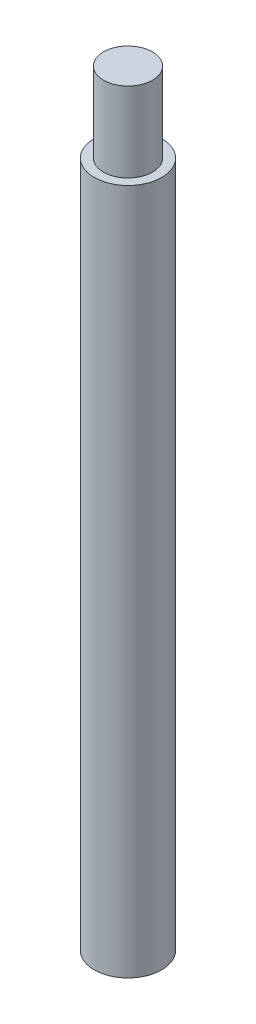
from build123d import *

# Parameters (mm, degrees)
SKETCH1_R           = 17.4625
BASE_EXTRUDE_DEPTH  = 355.6
SKETCH2_R           = 12.7
BOSS_EXTRUDE1_DEPTH = 41.275


with BuildPart() as part:
    # Sketch1 → Base-Extrude (new body)
    with BuildSketch(Plane(origin=(0, 0, 0), x_dir=(1, 0, 0), z_dir=(0, 1, 0))):
        with Locations(Location((0, 0, 0), (0, 0, 270))):
            Circle(SKETCH1_R)
    extrude(amount=BASE_EXTRUDE_DEPTH)

    # Sketch2 → Boss-Extrude1 (add)
    with BuildSketch(Plane(origin=(0, 355.6, 0), x_dir=(-1, 0, 0), z_dir=(0, 1, 0))):
        with Locations(Location((0, 0, 0), (0, 0, 90))):
            Circle(SKETCH2_R)
    extrude(amount=BOSS_EXTRUDE1_DEPTH)


solid = part.part
